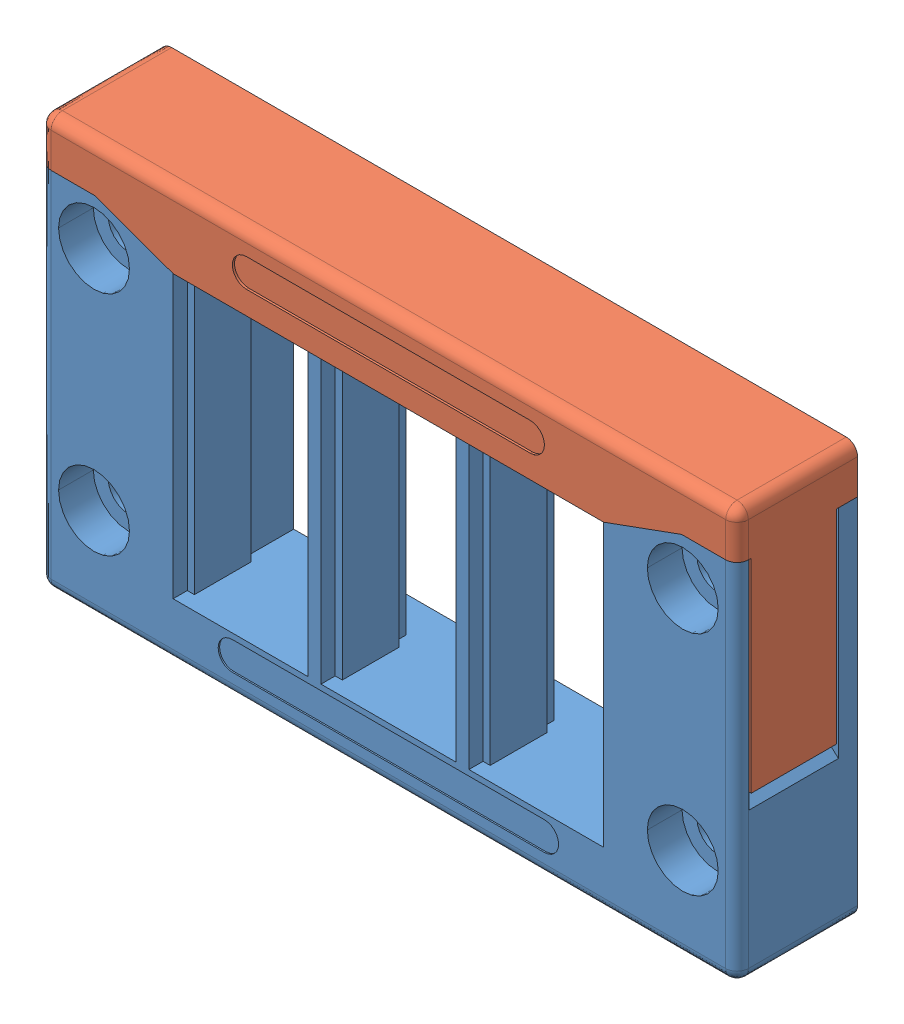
SolidWorks assembly 42420.SLDASM, configuration Default (file format 8000). Lengths in mm.
Overall size (98.3 58 17).
2 component instances, 2 part files, 0 mates.
Components (placement in the parent):
- 42420_01-1: 42420_01.SLDPRT [Default] at origin size (98.3 51.5 17)
- 42420_02-1: 42420_02.SLDPRT [Default] at origin size (98.3 35.2 17)
